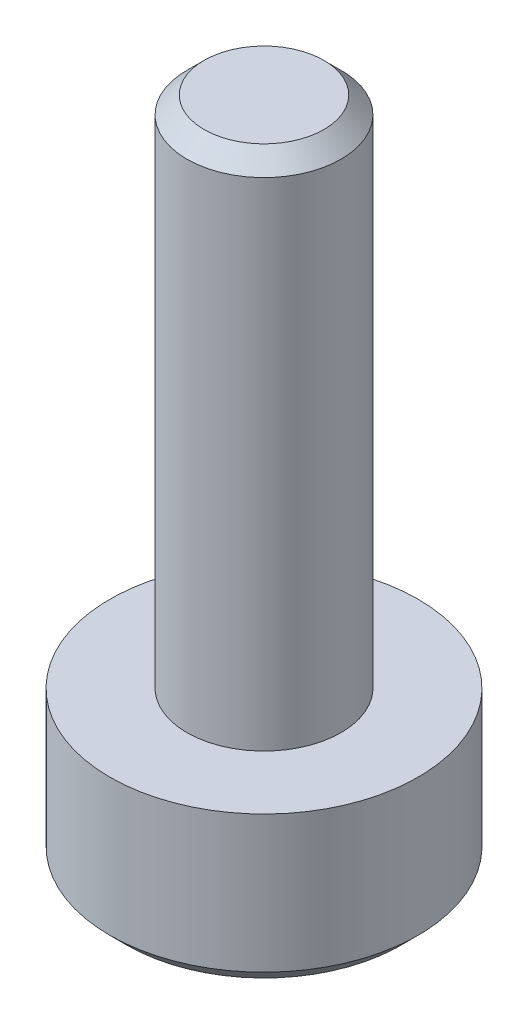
from build123d import *

# Parameters (mm, degrees)
SKETCH1_R           = 1.5
BOSS_EXTRUDE1_DEPTH = 10
SKETCH2_R           = 3
BOSS_EXTRUDE2_DEPTH = 3
CUT_EXTRUDE1_DEPTH  = 2
CHAMFER1_SIZE       = 0.333333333


with BuildPart() as part:
    # Sketch1 → Boss-Extrude1 (new body)
    with BuildSketch(Plane(origin=(0, 0, 0), x_dir=(1, 0, 0), z_dir=(0, 1, 0))):
        with Locations(Location((0, 0, 0), (0, 0, 270))):
            Circle(SKETCH1_R)
    extrude(amount=BOSS_EXTRUDE1_DEPTH)

    # Sketch2 → Boss-Extrude2 (add)
    with BuildSketch(Plane.XZ):
        with Locations(Location((0, 0, 0), (0, 0, 270))):
            Circle(SKETCH2_R)
    extrude(amount=BOSS_EXTRUDE2_DEPTH)

    # Sketch3 → Cut-Extrude1 (cut)
    with BuildSketch(Plane.XZ.offset(3)):
        Polygon((0, 1.732050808), (-1.5, 0.866025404), (-1.5, -0.866025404), (0, -1.732050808), (1.5, -0.866025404), (1.5, 0.866025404), align=None)
    extrude(amount=-CUT_EXTRUDE1_DEPTH, mode=Mode.SUBTRACT)

    # Chamfer1
    chamfer1_edges = [part.edges().sort_by_distance(p)[0] for p in [
        (0, 10, -1.5),
        (0, -3, 3),
    ]]
    chamfer(chamfer1_edges, length=CHAMFER1_SIZE)


solid = part.part
